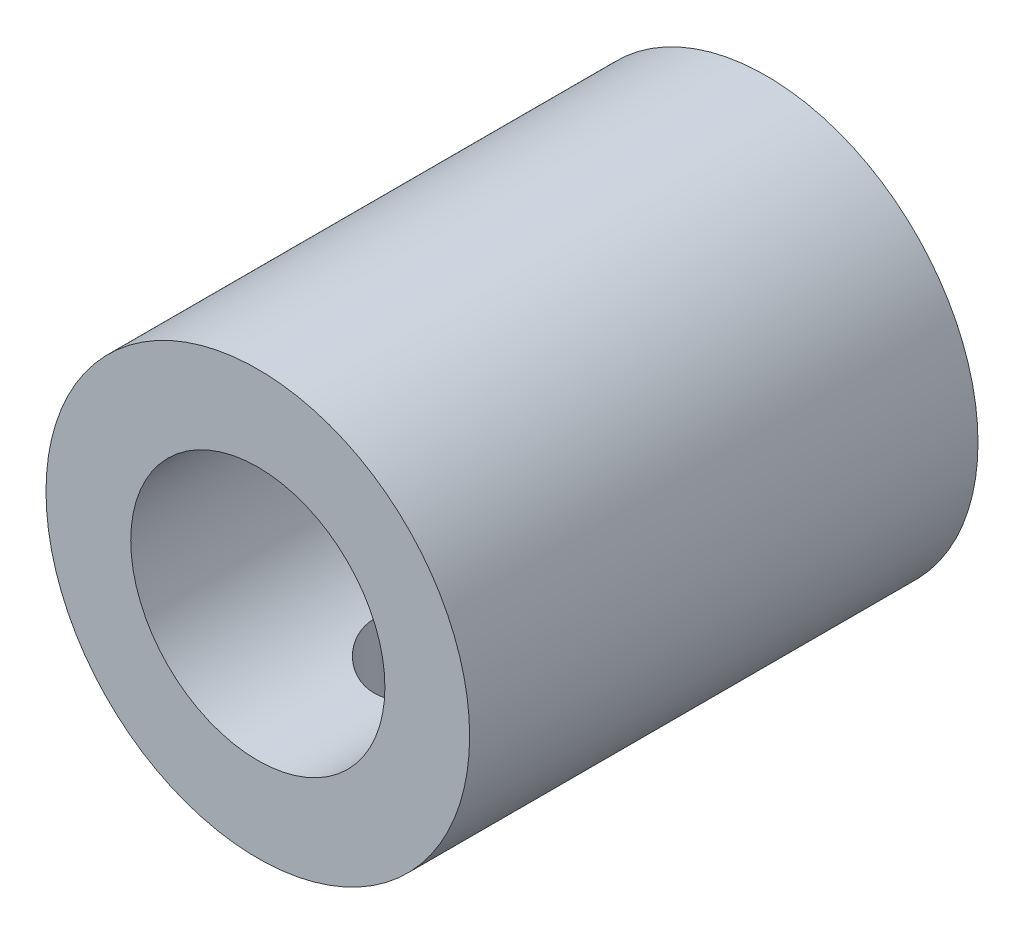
ISO-10303-21;
HEADER;
FILE_DESCRIPTION(('STEP AP214'),'2;1');
FILE_NAME('part.step','',(''),(''),'','','');
FILE_SCHEMA(('AUTOMOTIVE_DESIGN { 1 0 10303 214 1 1 1 1 }'));
ENDSEC;
DATA;
#1=APPLICATION_CONTEXT('core data for automotive mechanical design processes');
#2=APPLICATION_PROTOCOL_DEFINITION('international standard','automotive_design',2000,#1);
#3=PRODUCT_CONTEXT('',#1,'mechanical');
#4=PRODUCT('Part','Part','',(#3));
#5=PRODUCT_RELATED_PRODUCT_CATEGORY('part','',(#4));
#6=PRODUCT_DEFINITION_FORMATION('','',#4);
#7=PRODUCT_DEFINITION_CONTEXT('part definition',#1,'design');
#8=PRODUCT_DEFINITION('design','',#6,#7);
#9=PRODUCT_DEFINITION_SHAPE('','',#8);
#10=(LENGTH_UNIT() NAMED_UNIT(*) SI_UNIT(.MILLI.,.METRE.));
#11=(NAMED_UNIT(*) PLANE_ANGLE_UNIT() SI_UNIT($,.RADIAN.));
#12=(NAMED_UNIT(*) SI_UNIT($,.STERADIAN.) SOLID_ANGLE_UNIT());
#13=UNCERTAINTY_MEASURE_WITH_UNIT(LENGTH_MEASURE(1.E-05),#10,'distance_accuracy_value','');
#14=(GEOMETRIC_REPRESENTATION_CONTEXT(3) GLOBAL_UNCERTAINTY_ASSIGNED_CONTEXT((#13)) GLOBAL_UNIT_ASSIGNED_CONTEXT((#10,
#11,#12)) REPRESENTATION_CONTEXT('',''));
#15=CARTESIAN_POINT('',(0.,0.,0.));
#16=DIRECTION('',(0.,0.,1.));
#17=DIRECTION('',(1.,0.,0.));
#18=AXIS2_PLACEMENT_3D('',#15,#16,#17);
#19=CARTESIAN_POINT('',(0.,0.,120.));
#20=DIRECTION('',(0.,0.,1.));
#21=DIRECTION('',(1.,0.,0.));
#22=AXIS2_PLACEMENT_3D('',#19,#20,#21);
#23=PLANE('',#22);
#24=CARTESIAN_POINT('',(0.,0.,120.));
#25=DIRECTION('',(0.,0.,1.));
#26=DIRECTION('',(1.,0.,0.));
#27=AXIS2_PLACEMENT_3D('',#24,#25,#26);
#28=CIRCLE('',#27,50.);
#29=CARTESIAN_POINT('',(50.,0.,120.));
#30=VERTEX_POINT('',#29);
#31=EDGE_CURVE('E10',#30,#30,#28,.T.);
#32=ORIENTED_EDGE('',*,*,#31,.T.);
#33=EDGE_LOOP('',(#32));
#34=FACE_BOUND('',#33,.T.);
#35=CARTESIAN_POINT('',(0.,0.,120.));
#36=DIRECTION('',(0.,0.,1.));
#37=DIRECTION('',(1.,0.,0.));
#38=AXIS2_PLACEMENT_3D('',#35,#36,#37);
#39=CIRCLE('',#38,30.);
#40=CARTESIAN_POINT('',(30.,0.,120.));
#41=VERTEX_POINT('',#40);
#42=EDGE_CURVE('E47',#41,#41,#39,.T.);
#43=ORIENTED_EDGE('',*,*,#42,.F.);
#44=EDGE_LOOP('',(#43));
#45=FACE_BOUND('',#44,.T.);
#46=ADVANCED_FACE('F29',(#34,#45),#23,.T.);
#47=CARTESIAN_POINT('',(0.,0.,0.));
#48=DIRECTION('',(0.,0.,1.));
#49=DIRECTION('',(1.,0.,0.));
#50=AXIS2_PLACEMENT_3D('',#47,#48,#49);
#51=PLANE('',#50);
#52=CARTESIAN_POINT('',(0.,0.,0.));
#53=DIRECTION('',(0.,0.,1.));
#54=DIRECTION('',(1.,0.,0.));
#55=AXIS2_PLACEMENT_3D('',#52,#53,#54);
#56=CIRCLE('',#55,50.);
#57=CARTESIAN_POINT('',(50.,0.,0.));
#58=VERTEX_POINT('',#57);
#59=EDGE_CURVE('E42',#58,#58,#56,.T.);
#60=ORIENTED_EDGE('',*,*,#59,.F.);
#61=EDGE_LOOP('',(#60));
#62=FACE_BOUND('',#61,.T.);
#63=CARTESIAN_POINT('',(0.,0.,0.));
#64=DIRECTION('',(0.,0.,1.));
#65=DIRECTION('',(1.,0.,0.));
#66=AXIS2_PLACEMENT_3D('',#63,#64,#65);
#67=CIRCLE('',#66,30.);
#68=CARTESIAN_POINT('',(30.,0.,0.));
#69=VERTEX_POINT('',#68);
#70=EDGE_CURVE('E49',#69,#69,#67,.T.);
#71=ORIENTED_EDGE('',*,*,#70,.T.);
#72=EDGE_LOOP('',(#71));
#73=FACE_BOUND('',#72,.T.);
#74=ADVANCED_FACE('F69',(#62,#73),#51,.F.);
#75=CARTESIAN_POINT('',(0.,0.,120.));
#76=DIRECTION('',(0.,0.,-1.));
#77=DIRECTION('',(-1.,0.,0.));
#78=AXIS2_PLACEMENT_3D('',#75,#76,#77);
#79=CYLINDRICAL_SURFACE('',#78,50.);
#80=CARTESIAN_POINT('',(0.,-50.,92.5));
#81=CARTESIAN_POINT('',(0.345345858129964,-49.9999991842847,92.499998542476));
#82=CARTESIAN_POINT('',(0.690720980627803,-49.9964131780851,92.4856762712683));
#83=CARTESIAN_POINT('',(1.37897685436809,-49.9821662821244,92.4285034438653));
#84=CARTESIAN_POINT('',(1.72185731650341,-49.9715045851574,92.3856496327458));
#85=CARTESIAN_POINT('',(2.40280021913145,-49.9433952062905,92.2717468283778));
#86=CARTESIAN_POINT('',(2.74086012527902,-49.9259440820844,92.2006835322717));
#87=CARTESIAN_POINT('',(3.40956959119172,-49.8847377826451,92.0309531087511));
#88=CARTESIAN_POINT('',(3.74021934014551,-49.8609827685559,91.932286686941));
#89=CARTESIAN_POINT('',(4.39143160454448,-49.8078501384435,91.7082770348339));
#90=CARTESIAN_POINT('',(4.71200589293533,-49.7784793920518,91.5829663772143));
#91=CARTESIAN_POINT('',(5.34133409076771,-49.7148890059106,91.3065586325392));
#92=CARTESIAN_POINT('',(5.65008793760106,-49.6806693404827,91.1554614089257));
#93=CARTESIAN_POINT('',(6.25375145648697,-49.6082958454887,90.8285920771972));
#94=CARTESIAN_POINT('',(6.54866132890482,-49.5701420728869,90.6528203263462));
#95=CARTESIAN_POINT('',(7.1227706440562,-49.4909095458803,90.2778258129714));
#96=CARTESIAN_POINT('',(7.40196939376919,-49.4498306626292,90.0786020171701));
#97=CARTESIAN_POINT('',(7.94789184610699,-49.3650557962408,89.6541575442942));
#98=CARTESIAN_POINT('',(8.21428968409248,-49.3213254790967,89.428524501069));
#99=CARTESIAN_POINT('',(8.7272289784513,-49.2331515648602,88.9558423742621));
#100=CARTESIAN_POINT('',(8.97377020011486,-49.188707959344,88.7087930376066));
#101=CARTESIAN_POINT('',(9.44541093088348,-49.100323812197,88.1948682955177));
#102=CARTESIAN_POINT('',(9.67050778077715,-49.0563833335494,87.9279904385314));
#103=CARTESIAN_POINT('',(10.097711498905,-48.9702329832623,87.3761758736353));
#104=CARTESIAN_POINT('',(10.2998189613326,-48.928023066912,87.0912396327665));
#105=CARTESIAN_POINT('',(10.6824846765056,-48.8459148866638,86.500778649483));
#106=CARTESIAN_POINT('',(10.8626766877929,-48.8060604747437,86.1950102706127));
#107=CARTESIAN_POINT('',(11.1965999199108,-48.7305394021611,85.568846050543));
#108=CARTESIAN_POINT('',(11.3503308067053,-48.6948727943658,85.2484500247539));
#109=CARTESIAN_POINT('',(11.6301059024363,-48.6288115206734,84.5953057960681));
#110=CARTESIAN_POINT('',(11.7561535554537,-48.5984161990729,84.2625591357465));
#111=CARTESIAN_POINT('',(11.9795435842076,-48.5438335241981,83.587070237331));
#112=CARTESIAN_POINT('',(12.0768866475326,-48.5196460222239,83.2443282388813));
#113=CARTESIAN_POINT('',(12.2403753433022,-48.4786569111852,82.5583280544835));
#114=CARTESIAN_POINT('',(12.3071067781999,-48.4617170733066,82.2152177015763));
#115=CARTESIAN_POINT('',(12.4116255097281,-48.4350541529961,81.5243376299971));
#116=CARTESIAN_POINT('',(12.4494131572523,-48.4253309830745,81.1765679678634));
#117=CARTESIAN_POINT('',(12.4957081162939,-48.4134057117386,80.4790058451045));
#118=CARTESIAN_POINT('',(12.5042195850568,-48.4112025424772,80.1292136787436));
#119=CARTESIAN_POINT('',(12.4918975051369,-48.4143835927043,79.4301839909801));
#120=CARTESIAN_POINT('',(12.4710643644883,-48.4197677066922,79.0809464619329));
#121=CARTESIAN_POINT('',(12.4011011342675,-48.4377326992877,78.3940872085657));
#122=CARTESIAN_POINT('',(12.3526702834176,-48.4501356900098,78.0563893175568));
#123=CARTESIAN_POINT('',(12.2284550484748,-48.4816355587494,77.3863881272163));
#124=CARTESIAN_POINT('',(12.1526711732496,-48.5007323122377,77.0540847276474));
#125=CARTESIAN_POINT('',(11.9743582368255,-48.5450633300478,76.3971404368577));
#126=CARTESIAN_POINT('',(11.8718278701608,-48.570297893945,76.0724999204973));
#127=CARTESIAN_POINT('',(11.6408201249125,-48.6261803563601,75.4330675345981));
#128=CARTESIAN_POINT('',(11.5123423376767,-48.6568283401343,75.1182758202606));
#129=CARTESIAN_POINT('',(11.2289731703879,-48.7230082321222,74.497477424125));
#130=CARTESIAN_POINT('',(11.0738287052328,-48.7585862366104,74.1915912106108));
#131=CARTESIAN_POINT('',(10.7391618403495,-48.8333880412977,73.5939319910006));
#132=CARTESIAN_POINT('',(10.5596393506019,-48.8726118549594,73.3021590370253));
#133=CARTESIAN_POINT('',(10.1774241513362,-48.9536330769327,72.7345248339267));
#134=CARTESIAN_POINT('',(9.97472805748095,-48.9954308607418,72.4586659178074));
#135=CARTESIAN_POINT('',(9.54752439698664,-49.0804665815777,71.9246231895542));
#136=CARTESIAN_POINT('',(9.32301640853,-49.1237045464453,71.6664397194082));
#137=CARTESIAN_POINT('',(8.84692110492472,-49.2117082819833,71.162262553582));
#138=CARTESIAN_POINT('',(8.59474378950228,-49.2564824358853,70.9168271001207));
#139=CARTESIAN_POINT('',(8.07050421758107,-49.3450870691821,70.448004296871));
#140=CARTESIAN_POINT('',(7.79844157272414,-49.388917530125,70.2246173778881));
#141=CARTESIAN_POINT('',(7.23621606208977,-49.4744177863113,69.8014228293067));
#142=CARTESIAN_POINT('',(6.94605248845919,-49.5160874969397,69.6016161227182));
#143=CARTESIAN_POINT('',(6.34956444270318,-49.5961043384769,69.227021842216));
#144=CARTESIAN_POINT('',(6.04324006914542,-49.6344514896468,69.052234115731));
#145=CARTESIAN_POINT('',(5.41541235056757,-49.7068756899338,68.7284210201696));
#146=CARTESIAN_POINT('',(5.0938600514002,-49.7409374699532,68.5794870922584));
#147=CARTESIAN_POINT('',(4.43881192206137,-49.8036664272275,68.3092999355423));
#148=CARTESIAN_POINT('',(4.10531602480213,-49.8323335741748,68.1880468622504));
#149=CARTESIAN_POINT('',(3.42883552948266,-49.8834453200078,67.9742401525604));
#150=CARTESIAN_POINT('',(3.08585241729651,-49.9058908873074,67.8816820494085));
#151=CARTESIAN_POINT('',(2.39289058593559,-49.9439131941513,67.7260368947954));
#152=CARTESIAN_POINT('',(2.04291203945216,-49.9594901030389,67.6629491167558));
#153=CARTESIAN_POINT('',(1.34763092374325,-49.983014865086,67.5680319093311));
#154=CARTESIAN_POINT('',(1.00243806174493,-49.9911478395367,67.5354435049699));
#155=CARTESIAN_POINT('',(0.310446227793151,-50.0002334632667,67.4990535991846));
#156=CARTESIAN_POINT('',(-0.0363527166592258,-50.0011862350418,67.4952516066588));
#157=CARTESIAN_POINT('',(-0.728982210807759,-49.9958850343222,67.5164658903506));
#158=CARTESIAN_POINT('',(-1.07481283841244,-49.9896316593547,67.541479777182));
#159=CARTESIAN_POINT('',(-1.76300446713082,-49.9700941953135,67.6201065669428));
#160=CARTESIAN_POINT('',(-2.10536548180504,-49.9568101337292,67.6737193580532));
#161=CARTESIAN_POINT('',(-2.77909750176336,-49.9238288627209,67.8080823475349));
#162=CARTESIAN_POINT('',(-3.11055621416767,-49.9042298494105,67.8884175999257));
#163=CARTESIAN_POINT('',(-3.76542622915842,-49.8590944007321,68.0757577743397));
#164=CARTESIAN_POINT('',(-4.08883763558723,-49.8335580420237,68.1827623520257));
#165=CARTESIAN_POINT('',(-4.72547495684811,-49.7772239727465,68.4226251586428));
#166=CARTESIAN_POINT('',(-5.03870011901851,-49.7464258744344,68.5554852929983));
#167=CARTESIAN_POINT('',(-5.65290579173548,-49.6803791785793,68.8460731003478));
#168=CARTESIAN_POINT('',(-5.95388607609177,-49.6451304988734,69.003801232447));
#169=CARTESIAN_POINT('',(-6.54690733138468,-49.5704438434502,69.3460209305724));
#170=CARTESIAN_POINT('',(-6.83869503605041,-49.5309426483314,69.5309376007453));
#171=CARTESIAN_POINT('',(-7.4057320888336,-49.4493397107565,69.924080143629));
#172=CARTESIAN_POINT('',(-7.68098127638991,-49.4072379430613,70.1323062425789));
#173=CARTESIAN_POINT('',(-8.21323439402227,-49.3215517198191,70.5707015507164));
#174=CARTESIAN_POINT('',(-8.47023554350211,-49.2779670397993,70.8008740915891));
#175=CARTESIAN_POINT('',(-8.96431645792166,-49.1904867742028,71.2816373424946));
#176=CARTESIAN_POINT('',(-9.20139599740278,-49.1465911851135,71.5322282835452));
#177=CARTESIAN_POINT('',(-9.65967669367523,-49.0586020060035,72.0586276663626));
#178=CARTESIAN_POINT('',(-9.88034430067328,-49.014530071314,72.3349045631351));
#179=CARTESIAN_POINT('',(-10.2976362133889,-48.9285610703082,72.9053832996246));
#180=CARTESIAN_POINT('',(-10.494260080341,-48.8866640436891,73.1995854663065));
#181=CARTESIAN_POINT('',(-10.8620404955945,-48.8062652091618,73.8039370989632));
#182=CARTESIAN_POINT('',(-11.0331976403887,-48.7677633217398,74.1140861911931));
#183=CARTESIAN_POINT('',(-11.3487546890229,-48.6952974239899,74.7482206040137));
#184=CARTESIAN_POINT('',(-11.493154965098,-48.6613333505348,75.0722057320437));
#185=CARTESIAN_POINT('',(-11.7532704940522,-48.5991607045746,75.7297668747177));
#186=CARTESIAN_POINT('',(-11.8691526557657,-48.5709188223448,76.0632736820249));
#187=CARTESIAN_POINT('',(-12.0723939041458,-48.5208024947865,76.7393414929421));
#188=CARTESIAN_POINT('',(-12.1597530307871,-48.4989280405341,77.081902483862));
#189=CARTESIAN_POINT('',(-12.3051825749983,-48.4622339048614,77.7734958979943));
#190=CARTESIAN_POINT('',(-12.363258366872,-48.4474129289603,78.1225271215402));
#191=CARTESIAN_POINT('',(-12.4496272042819,-48.4252907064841,78.8244891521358));
#192=CARTESIAN_POINT('',(-12.4779209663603,-48.4179892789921,79.177419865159));
#193=CARTESIAN_POINT('',(-12.5040902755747,-48.4112372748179,79.8743094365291));
#194=CARTESIAN_POINT('',(-12.5028170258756,-48.4115670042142,80.2182344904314));
#195=CARTESIAN_POINT('',(-12.4719496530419,-48.4195283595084,80.9047211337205));
#196=CARTESIAN_POINT('',(-12.4423561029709,-48.4271598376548,81.2472827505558));
#197=CARTESIAN_POINT('',(-12.3551031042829,-48.449493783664,81.9285662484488));
#198=CARTESIAN_POINT('',(-12.2974444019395,-48.4641960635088,82.2672882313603));
#199=CARTESIAN_POINT('',(-12.1545443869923,-48.5002316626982,82.9385012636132));
#200=CARTESIAN_POINT('',(-12.0693029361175,-48.521565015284,83.2709922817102));
#201=CARTESIAN_POINT('',(-11.872520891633,-48.5700879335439,83.9254704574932));
#202=CARTESIAN_POINT('',(-11.7611408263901,-48.5972416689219,84.2475085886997));
#203=CARTESIAN_POINT('',(-11.512668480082,-48.6567032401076,84.8810071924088));
#204=CARTESIAN_POINT('',(-11.3755763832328,-48.6890110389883,85.1924677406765));
#205=CARTESIAN_POINT('',(-11.0766699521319,-48.7578803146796,85.8028328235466));
#206=CARTESIAN_POINT('',(-10.9148532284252,-48.7944422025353,86.1017361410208));
#207=CARTESIAN_POINT('',(-10.567632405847,-48.8708167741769,86.6850856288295));
#208=CARTESIAN_POINT('',(-10.3822273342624,-48.9106295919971,86.9695312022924));
#209=CARTESIAN_POINT('',(-9.98393796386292,-48.9935038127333,87.5294132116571));
#210=CARTESIAN_POINT('',(-9.77046302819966,-49.0366228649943,87.8044211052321));
#211=CARTESIAN_POINT('',(-9.32142482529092,-49.1239589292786,88.3355856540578));
#212=CARTESIAN_POINT('',(-9.08586116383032,-49.1681759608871,88.5917419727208));
#213=CARTESIAN_POINT('',(-8.59419030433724,-49.2564946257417,89.0835452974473));
#214=CARTESIAN_POINT('',(-8.3380828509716,-49.3005962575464,89.3191920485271));
#215=CARTESIAN_POINT('',(-7.80686919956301,-49.387500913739,89.7685140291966));
#216=CARTESIAN_POINT('',(-7.53175479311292,-49.4303033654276,89.9821796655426));
#217=CARTESIAN_POINT('',(-6.95924298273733,-49.5141811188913,90.3896396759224));
#218=CARTESIAN_POINT('',(-6.66153155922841,-49.5552109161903,90.5830025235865));
#219=CARTESIAN_POINT('',(-6.05050823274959,-49.6335185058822,90.943818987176));
#220=CARTESIAN_POINT('',(-5.73720336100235,-49.6707979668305,91.1112841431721));
#221=CARTESIAN_POINT('',(-5.09716652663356,-49.7405516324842,91.4190604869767));
#222=CARTESIAN_POINT('',(-4.7704398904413,-49.7730277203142,91.5593823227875));
#223=CARTESIAN_POINT('',(-4.10578919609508,-49.8322560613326,91.8118084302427));
#224=CARTESIAN_POINT('',(-3.7678668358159,-49.8590091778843,91.9239169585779));
#225=CARTESIAN_POINT('',(-3.14787089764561,-49.9015878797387,92.1005925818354));
#226=CARTESIAN_POINT('',(-2.86728001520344,-49.918522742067,92.1701379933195));
#227=CARTESIAN_POINT('',(-2.30172947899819,-49.9477946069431,92.2896522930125));
#228=CARTESIAN_POINT('',(-2.01677013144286,-49.9601319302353,92.339622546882));
#229=CARTESIAN_POINT('',(-1.44387788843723,-49.9799697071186,92.4196972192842));
#230=CARTESIAN_POINT('',(-1.15594470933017,-49.9874696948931,92.4497997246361));
#231=CARTESIAN_POINT('',(-0.578680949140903,-49.9974845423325,92.4899491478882));
#232=CARTESIAN_POINT('',(-0.289350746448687,-50.0000006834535,92.500001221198));
#233=CARTESIAN_POINT('',(0.,-50.,92.5));
#234=B_SPLINE_CURVE_WITH_KNOTS('',3,(#80,#81,#82,#83,#84,#85,#86,#87,#88,#89,#90,#91,#92,#93,
#94,#95,#96,#97,#98,#99,#100,#101,#102,#103,#104,#105,#106,#107,#108,#109,#110,#111,#112,#113,
#114,#115,#116,#117,#118,#119,#120,#121,#122,#123,#124,#125,#126,#127,#128,#129,#130,#131,#132,
#133,#134,#135,#136,#137,#138,#139,#140,#141,#142,#143,#144,#145,#146,#147,#148,#149,#150,#151,
#152,#153,#154,#155,#156,#157,#158,#159,#160,#161,#162,#163,#164,#165,#166,#167,#168,#169,#170,
#171,#172,#173,#174,#175,#176,#177,#178,#179,#180,#181,#182,#183,#184,#185,#186,#187,#188,#189,
#190,#191,#192,#193,#194,#195,#196,#197,#198,#199,#200,#201,#202,#203,#204,#205,#206,#207,#208,
#209,#210,#211,#212,#213,#214,#215,#216,#217,#218,#219,#220,#221,#222,#223,#224,#225,#226,#227,
#228,#229,#230,#231,#232,#233),.UNSPECIFIED.,.T.,.F.,(4,2,2,2,2,2,2,2,2,2,2,2,2,2,2,2,2,2,2,2,2,
2,2,2,2,2,2,2,2,2,2,2,2,2,2,2,2,2,2,2,2,2,2,2,2,2,2,2,2,2,2,2,2,2,2,2,2,2,2,2,2,2,2,2,2,2,2,2,2,
2,2,2,2,2,2,2,4),(0.,1.03577386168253,2.0716659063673,3.10808384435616,4.14447529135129,
5.1796069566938,6.21474410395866,7.24986626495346,8.2850340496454,9.33933066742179,
10.3936397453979,11.4480793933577,12.5024917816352,13.5726259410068,14.6427736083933,
15.7127880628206,16.7827768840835,17.8313349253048,18.879880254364,19.928276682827,
20.97665853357,21.9995889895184,23.0225004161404,24.0454617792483,25.0684392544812,
26.1017236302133,27.1350118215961,28.1684511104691,29.2019103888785,30.2648664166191,
31.3278432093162,32.3908615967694,33.4538735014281,34.520571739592,35.5872759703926,
36.6538140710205,37.7203258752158,38.7595309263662,39.7987182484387,40.8378194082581,
41.8769165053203,42.9005782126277,43.9242267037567,44.9479506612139,45.9716935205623,
47.0135955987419,48.0555077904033,49.0975784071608,50.1396608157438,51.2073584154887,
52.2750754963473,53.3427675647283,54.4104447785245,55.4717160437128,56.5329858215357,
57.5940607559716,58.6551101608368,59.6856519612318,60.7161729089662,61.7466664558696,
62.777165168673,63.8014935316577,64.8258145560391,65.8502346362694,66.8746969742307,
67.9258821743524,68.9770861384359,70.0283031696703,71.0799770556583,72.1507569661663,
73.2210583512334,74.2909390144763,75.3606581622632,76.22868967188,77.0966606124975,
77.9647151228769,78.8325464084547),.UNSPECIFIED.);
#235=CARTESIAN_POINT('',(0.,-50.,92.5));
#236=VERTEX_POINT('',#235);
#237=EDGE_CURVE('E52',#236,#236,#234,.T.);
#238=ORIENTED_EDGE('',*,*,#237,.T.);
#239=EDGE_LOOP('',(#238));
#240=FACE_BOUND('',#239,.T.);
#241=ORIENTED_EDGE('',*,*,#31,.F.);
#242=EDGE_LOOP('',(#241));
#243=FACE_BOUND('',#242,.T.);
#244=ORIENTED_EDGE('',*,*,#59,.T.);
#245=EDGE_LOOP('',(#244));
#246=FACE_BOUND('',#245,.T.);
#247=ADVANCED_FACE('F31',(#240,#243,#246),#79,.T.);
#248=CARTESIAN_POINT('',(0.,0.,120.));
#249=DIRECTION('',(0.,0.,-1.));
#250=DIRECTION('',(-1.,0.,0.));
#251=AXIS2_PLACEMENT_3D('',#248,#249,#250);
#252=CYLINDRICAL_SURFACE('',#251,30.);
#253=CARTESIAN_POINT('',(0.,-30.,92.5));
#254=CARTESIAN_POINT('',(0.334927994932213,-29.9999981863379,92.4999977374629));
#255=CARTESIAN_POINT('',(0.669969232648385,-29.9943758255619,92.486520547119));
#256=CARTESIAN_POINT('',(1.33766632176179,-29.9720264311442,92.4327370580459));
#257=CARTESIAN_POINT('',(1.67032052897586,-29.9552923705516,92.392413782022));
#258=CARTESIAN_POINT('',(2.33141399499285,-29.9111099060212,92.2852303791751));
#259=CARTESIAN_POINT('',(2.6598415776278,-29.8836365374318,92.2183084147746));
#260=CARTESIAN_POINT('',(3.30927507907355,-29.8187055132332,92.0586280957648));
#261=CARTESIAN_POINT('',(3.63028213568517,-29.7812493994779,91.9658737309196));
#262=CARTESIAN_POINT('',(4.26171378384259,-29.6974560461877,91.7557704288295));
#263=CARTESIAN_POINT('',(4.57217045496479,-29.6511492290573,91.6385056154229));
#264=CARTESIAN_POINT('',(5.18172511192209,-29.5507216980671,91.3802154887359));
#265=CARTESIAN_POINT('',(5.48082269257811,-29.4966007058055,91.2391893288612));
#266=CARTESIAN_POINT('',(6.06576848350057,-29.3818863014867,90.9345841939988));
#267=CARTESIAN_POINT('',(6.35162423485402,-29.3212966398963,90.7710182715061));
#268=CARTESIAN_POINT('',(6.90885718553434,-29.195022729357,90.4223682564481));
#269=CARTESIAN_POINT('',(7.18022866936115,-29.1293364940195,90.23727575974));
#270=CARTESIAN_POINT('',(7.71899587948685,-28.9913419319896,89.8379161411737));
#271=CARTESIAN_POINT('',(7.98564991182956,-28.9188683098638,89.6227051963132));
#272=CARTESIAN_POINT('',(8.50020440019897,-28.7718294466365,89.1713525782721));
#273=CARTESIAN_POINT('',(8.74809623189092,-28.6972632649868,88.9352013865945));
#274=CARTESIAN_POINT('',(9.22373535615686,-28.5479397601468,88.443327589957));
#275=CARTESIAN_POINT('',(9.45147667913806,-28.47318238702,88.1875992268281));
#276=CARTESIAN_POINT('',(9.88544327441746,-28.3254401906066,87.6580161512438));
#277=CARTESIAN_POINT('',(10.0916685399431,-28.2524553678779,87.3841614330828));
#278=CARTESIAN_POINT('',(10.4910002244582,-28.1066952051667,86.8057657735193));
#279=CARTESIAN_POINT('',(10.682949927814,-28.034109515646,86.500376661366));
#280=CARTESIAN_POINT('',(11.0402052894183,-27.8953507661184,85.8731647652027));
#281=CARTESIAN_POINT('',(11.2055219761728,-27.8291750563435,85.5513488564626));
#282=CARTESIAN_POINT('',(11.5081323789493,-27.7054079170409,84.8932624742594));
#283=CARTESIAN_POINT('',(11.6454310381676,-27.6478149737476,84.5569945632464));
#284=CARTESIAN_POINT('',(11.8906444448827,-27.5432454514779,83.8723085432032));
#285=CARTESIAN_POINT('',(11.9985613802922,-27.4962680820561,83.5238913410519));
#286=CARTESIAN_POINT('',(12.1793207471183,-27.4166633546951,82.8345930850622));
#287=CARTESIAN_POINT('',(12.2536013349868,-27.3834541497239,82.494156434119));
#288=CARTESIAN_POINT('',(12.373567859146,-27.3294560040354,81.8073011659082));
#289=CARTESIAN_POINT('',(12.4192546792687,-27.3086666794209,81.4608827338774));
#290=CARTESIAN_POINT('',(12.4814516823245,-27.280295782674,80.7650603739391));
#291=CARTESIAN_POINT('',(12.4979756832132,-27.2727079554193,80.4156579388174));
#292=CARTESIAN_POINT('',(12.5016740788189,-27.2710131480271,79.7166741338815));
#293=CARTESIAN_POINT('',(12.4888500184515,-27.2769054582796,79.3670927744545));
#294=CARTESIAN_POINT('',(12.4361337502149,-27.3009764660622,78.6974748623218));
#295=CARTESIAN_POINT('',(12.3983953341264,-27.3181771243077,78.377230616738));
#296=CARTESIAN_POINT('',(12.298461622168,-27.3633120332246,77.7413706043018));
#297=CARTESIAN_POINT('',(12.2362677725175,-27.3912456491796,77.425754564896));
#298=CARTESIAN_POINT('',(12.088037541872,-27.4569828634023,76.8011898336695));
#299=CARTESIAN_POINT('',(12.0019978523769,-27.4947878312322,76.4922420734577));
#300=CARTESIAN_POINT('',(11.8068700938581,-27.5791425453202,75.8829427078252));
#301=CARTESIAN_POINT('',(11.6977811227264,-27.6256926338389,75.5825914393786));
#302=CARTESIAN_POINT('',(11.4549295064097,-27.7272837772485,74.9859698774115));
#303=CARTESIAN_POINT('',(11.3206961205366,-27.7824828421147,74.6899183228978));
#304=CARTESIAN_POINT('',(11.030118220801,-27.8991218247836,74.1100326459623));
#305=CARTESIAN_POINT('',(10.873765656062,-27.9605640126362,73.826203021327));
#306=CARTESIAN_POINT('',(10.540015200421,-28.0880754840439,73.2722470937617));
#307=CARTESIAN_POINT('',(10.3626144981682,-28.154145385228,73.0021226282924));
#308=CARTESIAN_POINT('',(9.98783756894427,-28.2892696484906,72.4768890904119));
#309=CARTESIAN_POINT('',(9.79046022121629,-28.3583241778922,72.2217808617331));
#310=CARTESIAN_POINT('',(9.35923598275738,-28.5036972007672,71.7068196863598));
#311=CARTESIAN_POINT('',(9.12371578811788,-28.5801350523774,71.448399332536));
#312=CARTESIAN_POINT('',(8.63189108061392,-28.7325025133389,70.952213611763));
#313=CARTESIAN_POINT('',(8.37559468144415,-28.8084323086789,70.7144402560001));
#314=CARTESIAN_POINT('',(7.84338442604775,-28.9578616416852,70.2607150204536));
#315=CARTESIAN_POINT('',(7.5674576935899,-29.0313595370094,70.0447776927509));
#316=CARTESIAN_POINT('',(6.99779831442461,-29.1739092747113,69.636430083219));
#317=CARTESIAN_POINT('',(6.70407296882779,-29.2429629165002,69.4440102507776));
#318=CARTESIAN_POINT('',(6.09334741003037,-29.3763690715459,69.079814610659));
#319=CARTESIAN_POINT('',(5.77596349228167,-29.440573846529,68.9086269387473));
#320=CARTESIAN_POINT('',(5.12627407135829,-29.5606228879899,68.5937906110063));
#321=CARTESIAN_POINT('',(4.79396818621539,-29.6164669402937,68.4501426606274));
#322=CARTESIAN_POINT('',(4.1169381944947,-29.7181414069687,68.1918662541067));
#323=CARTESIAN_POINT('',(3.77221970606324,-29.7639762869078,68.0772248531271));
#324=CARTESIAN_POINT('',(3.07288274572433,-29.8442829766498,67.8781380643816));
#325=CARTESIAN_POINT('',(2.71826502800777,-29.8787556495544,67.793690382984));
#326=CARTESIAN_POINT('',(2.02472167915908,-29.9334888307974,67.6603403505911));
#327=CARTESIAN_POINT('',(1.68622252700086,-29.9545104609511,67.6095273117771));
#328=CARTESIAN_POINT('',(1.00568521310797,-29.9850727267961,67.5358225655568));
#329=CARTESIAN_POINT('',(0.663647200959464,-29.9946138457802,67.5129296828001));
#330=CARTESIAN_POINT('',(-0.0211925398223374,-30.0019464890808,67.4953266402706));
#331=CARTESIAN_POINT('',(-0.363994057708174,-29.9997409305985,67.5006094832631));
#332=CARTESIAN_POINT('',(-1.04772650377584,-29.9836488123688,67.539281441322));
#333=CARTESIAN_POINT('',(-1.38865747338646,-29.9697625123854,67.5726699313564));
#334=CARTESIAN_POINT('',(-2.04913531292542,-29.9316720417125,67.6648207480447));
#335=CARTESIAN_POINT('',(-2.36890262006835,-29.9080151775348,67.7222390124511));
#336=CARTESIAN_POINT('',(-3.0021713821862,-29.8510976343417,67.8615458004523));
#337=CARTESIAN_POINT('',(-3.31567309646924,-29.8178373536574,67.943433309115));
#338=CARTESIAN_POINT('',(-3.93442892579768,-29.7425187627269,68.130931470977));
#339=CARTESIAN_POINT('',(-4.23968242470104,-29.7004597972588,68.23654389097));
#340=CARTESIAN_POINT('',(-4.84009601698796,-29.6085414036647,68.4705897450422));
#341=CARTESIAN_POINT('',(-5.1352557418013,-29.5586816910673,68.5990240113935));
#342=CARTESIAN_POINT('',(-5.72275808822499,-29.4506702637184,68.8820143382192));
#343=CARTESIAN_POINT('',(-6.01473303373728,-29.3923102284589,69.0372538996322));
#344=CARTESIAN_POINT('',(-6.58469831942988,-29.2698950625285,69.3698229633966));
#345=CARTESIAN_POINT('',(-6.86268344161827,-29.2058378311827,69.5471606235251));
#346=CARTESIAN_POINT('',(-7.40316981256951,-29.0735361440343,69.9227290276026));
#347=CARTESIAN_POINT('',(-7.66566849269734,-29.0052909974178,70.1209632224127));
#348=CARTESIAN_POINT('',(-8.17384122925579,-28.8662039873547,70.5371151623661));
#349=CARTESIAN_POINT('',(-8.41951446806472,-28.7953619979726,70.7550338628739));
#350=CARTESIAN_POINT('',(-8.90982003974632,-28.6476051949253,71.2256787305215));
#351=CARTESIAN_POINT('',(-9.15311243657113,-28.5706194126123,71.4797805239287));
#352=CARTESIAN_POINT('',(-9.61746452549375,-28.417672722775,72.0076351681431));
#353=CARTESIAN_POINT('',(-9.83853319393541,-28.3417114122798,72.2813800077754));
#354=CARTESIAN_POINT('',(-10.2573201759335,-28.1928503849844,72.8472825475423));
#355=CARTESIAN_POINT('',(-10.4550224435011,-28.1199527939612,73.1394526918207));
#356=CARTESIAN_POINT('',(-10.8254422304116,-27.9794395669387,73.7402644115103));
#357=CARTESIAN_POINT('',(-10.9981703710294,-27.9118216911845,74.0488989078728));
#358=CARTESIAN_POINT('',(-11.3196985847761,-27.7829961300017,74.6855451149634));
#359=CARTESIAN_POINT('',(-11.4681135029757,-27.7218961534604,75.0137735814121));
#360=CARTESIAN_POINT('',(-11.736523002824,-27.6093323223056,75.6832782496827));
#361=CARTESIAN_POINT('',(-11.856517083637,-27.5578686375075,76.0245546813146));
#362=CARTESIAN_POINT('',(-12.0667172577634,-27.4664792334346,76.7174250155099));
#363=CARTESIAN_POINT('',(-12.1569438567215,-27.4265455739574,77.0690116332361));
#364=CARTESIAN_POINT('',(-12.306624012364,-27.3597104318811,77.7798868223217));
#365=CARTESIAN_POINT('',(-12.3660804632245,-27.332807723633,78.139174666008));
#366=CARTESIAN_POINT('',(-12.4500822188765,-27.2946403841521,78.8344656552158));
#367=CARTESIAN_POINT('',(-12.4769635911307,-27.2823309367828,79.1701309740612));
#368=CARTESIAN_POINT('',(-12.5035409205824,-27.2701611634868,79.8427548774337));
#369=CARTESIAN_POINT('',(-12.503238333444,-27.2703001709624,80.1797133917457));
#370=CARTESIAN_POINT('',(-12.4754549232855,-27.2830212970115,80.8522183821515));
#371=CARTESIAN_POINT('',(-12.4479778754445,-27.2956016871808,81.187765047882));
#372=CARTESIAN_POINT('',(-12.3661763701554,-27.3327586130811,81.8548898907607));
#373=CARTESIAN_POINT('',(-12.3118521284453,-27.3573350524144,82.1864680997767));
#374=CARTESIAN_POINT('',(-12.1801341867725,-27.4162226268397,82.8277966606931));
#375=CARTESIAN_POINT('',(-12.1039406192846,-27.4500237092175,83.1378418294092));
#376=CARTESIAN_POINT('',(-11.928413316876,-27.52675288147,83.7502612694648));
#377=CARTESIAN_POINT('',(-11.8290715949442,-27.5696841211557,84.0526328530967));
#378=CARTESIAN_POINT('',(-11.6081133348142,-27.6634432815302,84.6478477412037));
#379=CARTESIAN_POINT('',(-11.4864967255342,-27.7142712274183,84.9406910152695));
#380=CARTESIAN_POINT('',(-11.221910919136,-27.8224573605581,85.5153226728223));
#381=CARTESIAN_POINT('',(-11.0789401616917,-27.87981602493,85.7971102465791));
#382=CARTESIAN_POINT('',(-10.7634011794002,-28.0032066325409,86.3648173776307));
#383=CARTESIAN_POINT('',(-10.5895704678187,-28.0695526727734,86.6499672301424));
#384=CARTESIAN_POINT('',(-10.2201609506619,-28.2061532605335,87.2048181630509));
#385=CARTESIAN_POINT('',(-10.0245814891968,-28.2764079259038,87.4745187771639));
#386=CARTESIAN_POINT('',(-9.61278874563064,-28.4190388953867,87.9971873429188));
#387=CARTESIAN_POINT('',(-9.39657050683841,-28.4914157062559,88.2501512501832));
#388=CARTESIAN_POINT('',(-8.94468989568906,-28.6364948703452,88.7380260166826));
#389=CARTESIAN_POINT('',(-8.70902493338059,-28.709197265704,88.9729344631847));
#390=CARTESIAN_POINT('',(-8.20156831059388,-28.8584340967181,89.4398987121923));
#391=CARTESIAN_POINT('',(-7.92839509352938,-28.9348601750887,89.6704908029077));
#392=CARTESIAN_POINT('',(-7.36275583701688,-29.0839359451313,90.1077978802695));
#393=CARTESIAN_POINT('',(-7.0702967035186,-29.1565869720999,90.3145213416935));
#394=CARTESIAN_POINT('',(-6.46750304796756,-29.2961972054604,90.7028043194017));
#395=CARTESIAN_POINT('',(-6.15715548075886,-29.3631521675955,90.8843451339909));
#396=CARTESIAN_POINT('',(-5.52075682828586,-29.4894294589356,91.2205494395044));
#397=CARTESIAN_POINT('',(-5.19470703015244,-29.5487524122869,91.3752151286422));
#398=CARTESIAN_POINT('',(-4.53460593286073,-29.6571636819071,91.6539078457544));
#399=CARTESIAN_POINT('',(-4.20077589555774,-29.706404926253,91.7783989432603));
#400=CARTESIAN_POINT('',(-3.52237260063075,-29.7944604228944,91.9987534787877));
#401=CARTESIAN_POINT('',(-3.17779755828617,-29.8332729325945,92.0946121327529));
#402=CARTESIAN_POINT('',(-2.48162991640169,-29.8992214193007,92.2563813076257));
#403=CARTESIAN_POINT('',(-2.13005975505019,-29.9263898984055,92.322375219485));
#404=CARTESIAN_POINT('',(-1.42200617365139,-29.9683747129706,92.423994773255));
#405=CARTESIAN_POINT('',(-1.06552655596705,-29.9832001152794,92.459642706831));
#406=CARTESIAN_POINT('',(-0.590277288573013,-29.9944248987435,92.4866144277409));
#407=CARTESIAN_POINT('',(-0.472292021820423,-29.9965144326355,92.4916326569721));
#408=CARTESIAN_POINT('',(-0.236209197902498,-29.9993023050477,92.4983258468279));
#409=CARTESIAN_POINT('',(-0.118111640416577,-30.000000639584,92.5000007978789));
#410=CARTESIAN_POINT('',(0.,-30.,92.5));
#411=B_SPLINE_CURVE_WITH_KNOTS('',3,(#253,#254,#255,#256,#257,#258,#259,#260,#261,#262,#263,
#264,#265,#266,#267,#268,#269,#270,#271,#272,#273,#274,#275,#276,#277,#278,#279,#280,#281,#282,
#283,#284,#285,#286,#287,#288,#289,#290,#291,#292,#293,#294,#295,#296,#297,#298,#299,#300,#301,
#302,#303,#304,#305,#306,#307,#308,#309,#310,#311,#312,#313,#314,#315,#316,#317,#318,#319,#320,
#321,#322,#323,#324,#325,#326,#327,#328,#329,#330,#331,#332,#333,#334,#335,#336,#337,#338,#339,
#340,#341,#342,#343,#344,#345,#346,#347,#348,#349,#350,#351,#352,#353,#354,#355,#356,#357,#358,
#359,#360,#361,#362,#363,#364,#365,#366,#367,#368,#369,#370,#371,#372,#373,#374,#375,#376,#377,
#378,#379,#380,#381,#382,#383,#384,#385,#386,#387,#388,#389,#390,#391,#392,#393,#394,#395,#396,
#397,#398,#399,#400,#401,#402,#403,#404,#405,#406,#407,#408,#409,#410),.UNSPECIFIED.,.T.,.F.,(4,
2,2,2,2,2,2,2,2,2,2,2,2,2,2,2,2,2,2,2,2,2,2,2,2,2,2,2,2,2,2,2,2,2,2,2,2,2,2,2,2,2,2,2,2,2,2,2,2,
2,2,2,2,2,2,2,2,2,2,2,2,2,2,2,2,2,2,2,2,2,2,2,2,2,2,2,2,2,4),(0.,1.00466377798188,
2.00996350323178,3.01761418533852,4.02510932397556,5.02920174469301,6.03332994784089,
7.03687909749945,8.04082136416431,9.09040763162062,10.1404734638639,11.190849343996,
12.2412255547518,13.343658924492,14.4456346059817,15.5474156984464,16.6491147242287,
17.6977885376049,18.7464299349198,19.7945743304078,20.8426635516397,21.8102841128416,
22.7778474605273,23.7455451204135,24.7132806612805,25.70137245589,26.6898248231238,
27.6784093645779,28.6670493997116,29.7395376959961,30.8116091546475,31.8843904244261,
32.9567345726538,34.0541608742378,35.1516152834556,36.2485790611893,37.3454594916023,
38.3729497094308,39.4003966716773,40.4275884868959,41.4547574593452,42.4308578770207,
43.4069178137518,44.3830504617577,45.3592187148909,46.3654951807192,47.3721442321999,
48.3789597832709,49.3858242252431,50.4649453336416,51.5436288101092,52.6230487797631,
53.7020083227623,54.7966829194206,55.8913768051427,56.9853150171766,58.0791503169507,
59.0887421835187,60.0982799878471,61.1076775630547,62.1170670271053,63.0791633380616,
64.0415921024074,65.0040239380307,65.9665261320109,66.986881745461,68.0072681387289,
69.0279002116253,70.0486684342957,71.1440527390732,72.2390469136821,73.3348499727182,
74.4305633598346,75.508170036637,76.5859566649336,77.6607149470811,78.7346830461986,
79.0889745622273,79.4432670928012),.UNSPECIFIED.);
#412=CARTESIAN_POINT('',(0.,-30.,92.5));
#413=VERTEX_POINT('',#412);
#414=EDGE_CURVE('E34',#413,#413,#411,.T.);
#415=ORIENTED_EDGE('',*,*,#414,.F.);
#416=EDGE_LOOP('',(#415));
#417=FACE_BOUND('',#416,.T.);
#418=ORIENTED_EDGE('',*,*,#42,.T.);
#419=EDGE_LOOP('',(#418));
#420=FACE_BOUND('',#419,.T.);
#421=ORIENTED_EDGE('',*,*,#70,.F.);
#422=EDGE_LOOP('',(#421));
#423=FACE_BOUND('',#422,.T.);
#424=ADVANCED_FACE('F61',(#417,#420,#423),#252,.F.);
#425=CARTESIAN_POINT('',(0.,-80.,80.));
#426=DIRECTION('',(0.,1.,0.));
#427=DIRECTION('',(0.,0.,1.));
#428=AXIS2_PLACEMENT_3D('',#425,#426,#427);
#429=CYLINDRICAL_SURFACE('',#428,12.5);
#430=ORIENTED_EDGE('',*,*,#414,.T.);
#431=EDGE_LOOP('',(#430));
#432=FACE_BOUND('',#431,.T.);
#433=ORIENTED_EDGE('',*,*,#237,.F.);
#434=EDGE_LOOP('',(#433));
#435=FACE_BOUND('',#434,.T.);
#436=ADVANCED_FACE('F58',(#432,#435),#429,.F.);
#437=CLOSED_SHELL('',(#46,#74,#247,#424,#436));
#438=MANIFOLD_SOLID_BREP('B2',#437);
#439=ADVANCED_BREP_SHAPE_REPRESENTATION('',(#18,#438),#14);
#440=SHAPE_DEFINITION_REPRESENTATION(#9,#439);
ENDSEC;
END-ISO-10303-21;
